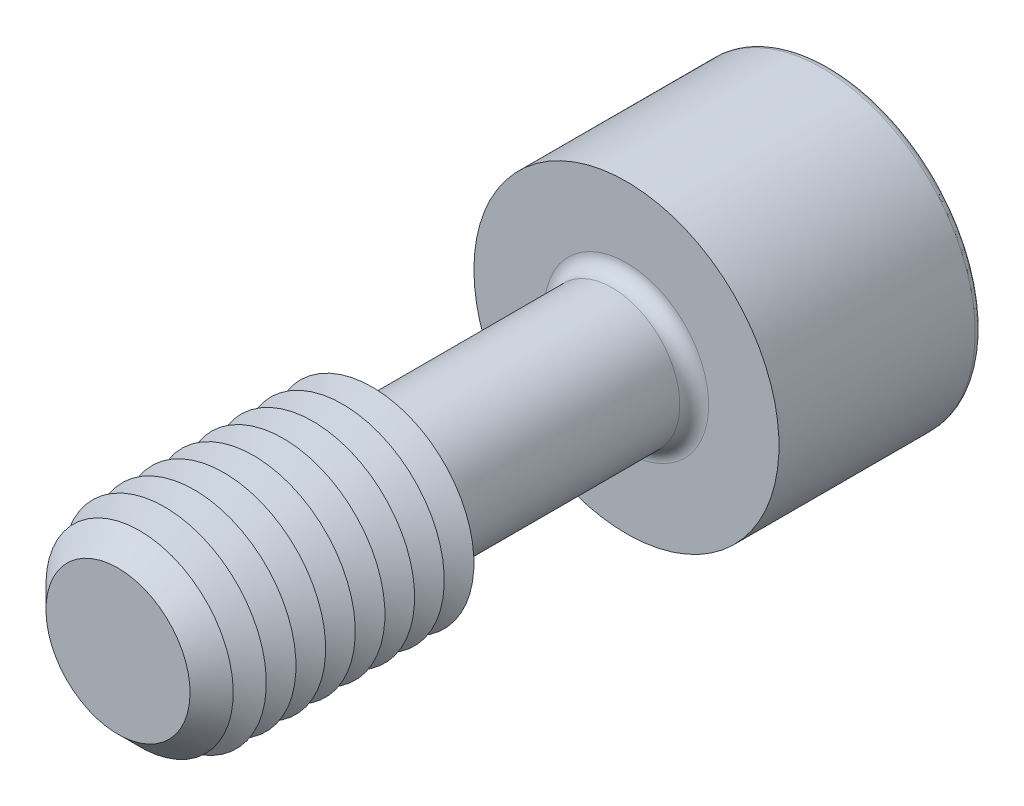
from build123d import *

# Parameters (mm, degrees)
SKETCH1_R       = 4
EXTRUDE1_DEPTH  = 15
CHAMFER1_SIZE   = 1.75
SKETCH3_R       = 9
EXTRUDE2_DEPTH  = 12
EXTRUDE3_DEPTH  = 10
FILLET1_R       = 0.85
FILLET2_R       = 0.425
LPATTERN1_COUNT = 8
LPATTERN1_PITCH = 1.75


with BuildPart() as part:
    # Sketch1 → Extrude1 (new, symmetric)
    with BuildSketch(Plane.XY):
        Circle(SKETCH1_R)
    extrude(amount=EXTRUDE1_DEPTH, both=True)

    # Sketch2 → Revolve1 (revolve)
    with BuildSketch(Plane(origin=(0, 0, 0), x_dir=(0, 0, -1), z_dir=(1, 0, 0))):
        Polygon((-15, 0), (-15, 6), (0, 6), (1.154700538, 4), (1.154700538, 0), align=None)
    revolve(axis=Axis((0, 0, -1.154700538), (0, 0, 1)))

    # Chamfer1
    chamfer1_edges = [part.edges().sort_by_distance(p)[0] for p in [
        (0, -6, 15),
    ]]
    chamfer(chamfer1_edges, length=CHAMFER1_SIZE)

    # Sketch3 → Extrude2 (add)
    with BuildSketch(Plane(origin=(0, 0, -15), x_dir=(-1, 0, 0), z_dir=(0, 0, -1))):
        Circle(SKETCH3_R)
    extrude(amount=EXTRUDE2_DEPTH)

    # Sketch4 → Extrude3 (cut)
    with BuildSketch(Plane(origin=(-13.7, 0, -27), x_dir=(1, 0, 0), z_dir=(0, 0, 1))):
        Polygon((10.813248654, -5), (16.586751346, -5), (19.473502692, 0), (16.586751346, 5), (10.813248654, 5), (7.926497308, 0), align=None)
    extrude(amount=EXTRUDE3_DEPTH, mode=Mode.SUBTRACT)

    # Fillet1
    fillet1_edges = [part.edges().sort_by_distance(p)[0] for p in [
        (-4, 0, -15),
    ]]
    fillet(fillet1_edges, radius=FILLET1_R)

    # Fillet2
    fillet2_edges = [part.edges().sort_by_distance(p)[0] for p in [
        (9, 0, -27),
    ]]
    fillet(fillet2_edges, radius=FILLET2_R)

    # Sketch5 → Cut-Revolve1 (revolve, cut)
    with BuildSketch(Plane(origin=(0, 0, 0), x_dir=(0, 0, -1), z_dir=(1, 0, 0)), mode=Mode.PRIVATE) as cut_revolve1_sk:
        Polygon((17, 0), (17, -5), (14.113248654, 0), align=None)
    revolve(cut_revolve1_sk.sketch.rotate(Axis((0, 0, -14.113248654), (0, 0, -1)), 90), axis=Axis((0, 0, -14.113248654), (0, 0, -1)), mode=Mode.SUBTRACT)

    # Sketch7 → Cut-Revolve2 (revolve, cut)
    with BuildSketch(Plane(origin=(0, 0, 0), x_dir=(0, 0, -1), z_dir=(1, 0, 0)), mode=Mode.PRIVATE) as cut_revolve2_sk:
        Polygon((0, 6), (-0.875, 4.484455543), (-1.75, 6), align=None)
    cut_revolve2 = revolve(cut_revolve2_sk.sketch.rotate(Axis((0, 0, -1.332048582), (0, 0, 1)), 90), axis=Axis((0, 0, -1.332048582), (0, 0, 1)), mode=Mode.SUBTRACT)

    # LPattern1: Cut-Revolve2 ×8
    with Locations(*[(0, 0, i * LPATTERN1_PITCH) for i in range(1, LPATTERN1_COUNT)]):
        add(cut_revolve2, mode=Mode.SUBTRACT)


solid = part.part
